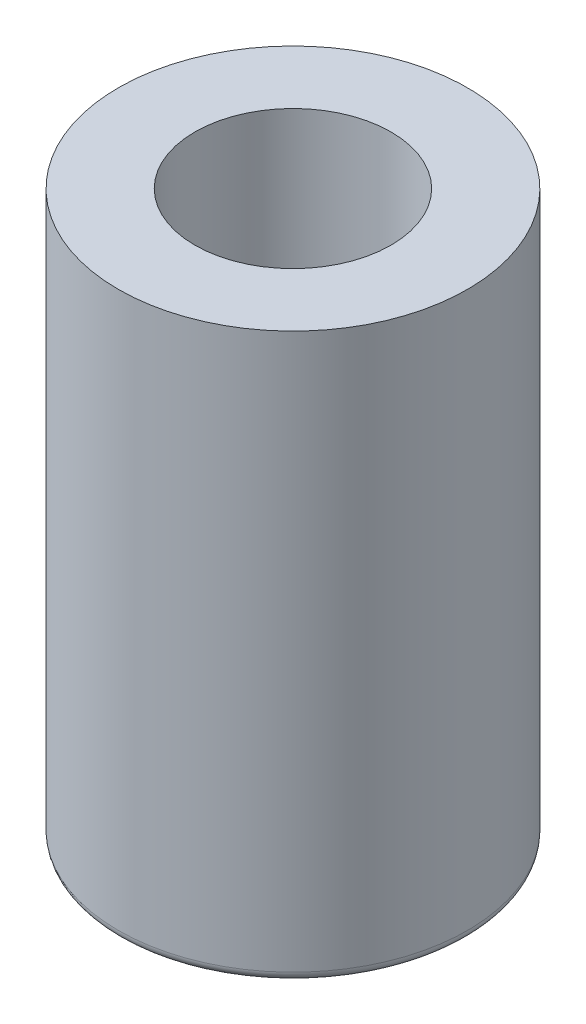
ISO-10303-21;
HEADER;
FILE_DESCRIPTION(('STEP AP214'),'2;1');
FILE_NAME('part.step','',(''),(''),'','','');
FILE_SCHEMA(('AUTOMOTIVE_DESIGN { 1 0 10303 214 1 1 1 1 }'));
ENDSEC;
DATA;
#1=APPLICATION_CONTEXT('core data for automotive mechanical design processes');
#2=APPLICATION_PROTOCOL_DEFINITION('international standard','automotive_design',2000,#1);
#3=PRODUCT_CONTEXT('',#1,'mechanical');
#4=PRODUCT('Part','Part','',(#3));
#5=PRODUCT_RELATED_PRODUCT_CATEGORY('part','',(#4));
#6=PRODUCT_DEFINITION_FORMATION('','',#4);
#7=PRODUCT_DEFINITION_CONTEXT('part definition',#1,'design');
#8=PRODUCT_DEFINITION('design','',#6,#7);
#9=PRODUCT_DEFINITION_SHAPE('','',#8);
#10=(LENGTH_UNIT() NAMED_UNIT(*) SI_UNIT(.MILLI.,.METRE.));
#11=(NAMED_UNIT(*) PLANE_ANGLE_UNIT() SI_UNIT($,.RADIAN.));
#12=(NAMED_UNIT(*) SI_UNIT($,.STERADIAN.) SOLID_ANGLE_UNIT());
#13=UNCERTAINTY_MEASURE_WITH_UNIT(LENGTH_MEASURE(1.E-05),#10,'distance_accuracy_value','');
#14=(GEOMETRIC_REPRESENTATION_CONTEXT(3) GLOBAL_UNCERTAINTY_ASSIGNED_CONTEXT((#13)) GLOBAL_UNIT_ASSIGNED_CONTEXT((#10,
#11,#12)) REPRESENTATION_CONTEXT('',''));
#15=CARTESIAN_POINT('',(0.,0.,0.));
#16=DIRECTION('',(0.,0.,1.));
#17=DIRECTION('',(1.,0.,0.));
#18=AXIS2_PLACEMENT_3D('',#15,#16,#17);
#19=CARTESIAN_POINT('',(0.,144.,0.));
#20=DIRECTION('',(0.,-1.,0.));
#21=DIRECTION('',(0.,0.,-1.));
#22=AXIS2_PLACEMENT_3D('',#19,#20,#21);
#23=CYLINDRICAL_SURFACE('',#22,44.5);
#24=CARTESIAN_POINT('',(0.,2.5,0.));
#25=DIRECTION('',(0.,1.,0.));
#26=DIRECTION('',(0.,0.,1.));
#27=AXIS2_PLACEMENT_3D('',#24,#25,#26);
#28=CIRCLE('',#27,44.5);
#29=CARTESIAN_POINT('',(0.,2.5,44.5));
#30=VERTEX_POINT('',#29);
#31=EDGE_CURVE('E36',#30,#30,#28,.T.);
#32=ORIENTED_EDGE('',*,*,#31,.T.);
#33=EDGE_LOOP('',(#32));
#34=FACE_BOUND('',#33,.T.);
#35=CARTESIAN_POINT('',(0.,144.,0.));
#36=DIRECTION('',(0.,1.,0.));
#37=DIRECTION('',(0.,0.,1.));
#38=AXIS2_PLACEMENT_3D('',#35,#36,#37);
#39=CIRCLE('',#38,44.5);
#40=CARTESIAN_POINT('',(0.,144.,44.5));
#41=VERTEX_POINT('',#40);
#42=EDGE_CURVE('E40',#41,#41,#39,.T.);
#43=ORIENTED_EDGE('',*,*,#42,.F.);
#44=EDGE_LOOP('',(#43));
#45=FACE_BOUND('',#44,.T.);
#46=ADVANCED_FACE('F29',(#34,#45),#23,.T.);
#47=CARTESIAN_POINT('',(0.,144.,0.));
#48=DIRECTION('',(0.,1.,0.));
#49=DIRECTION('',(0.,0.,1.));
#50=AXIS2_PLACEMENT_3D('',#47,#48,#49);
#51=PLANE('',#50);
#52=CARTESIAN_POINT('',(0.,144.,0.));
#53=DIRECTION('',(0.,1.,0.));
#54=DIRECTION('',(0.,0.,1.));
#55=AXIS2_PLACEMENT_3D('',#52,#53,#54);
#56=CIRCLE('',#55,25.);
#57=CARTESIAN_POINT('',(0.,144.,25.));
#58=VERTEX_POINT('',#57);
#59=EDGE_CURVE('E47',#58,#58,#56,.T.);
#60=ORIENTED_EDGE('',*,*,#59,.F.);
#61=EDGE_LOOP('',(#60));
#62=FACE_BOUND('',#61,.T.);
#63=ORIENTED_EDGE('',*,*,#42,.T.);
#64=EDGE_LOOP('',(#63));
#65=FACE_BOUND('',#64,.T.);
#66=ADVANCED_FACE('F61',(#62,#65),#51,.T.);
#67=CARTESIAN_POINT('',(0.,0.,0.));
#68=DIRECTION('',(0.,1.,0.));
#69=DIRECTION('',(0.,0.,1.));
#70=AXIS2_PLACEMENT_3D('',#67,#68,#69);
#71=PLANE('',#70);
#72=CARTESIAN_POINT('',(0.,0.,0.));
#73=DIRECTION('',(0.,1.,0.));
#74=DIRECTION('',(0.,0.,1.));
#75=AXIS2_PLACEMENT_3D('',#72,#73,#74);
#76=CIRCLE('',#75,42.);
#77=CARTESIAN_POINT('',(0.,0.,42.));
#78=VERTEX_POINT('',#77);
#79=EDGE_CURVE('E11',#78,#78,#76,.F.);
#80=ORIENTED_EDGE('',*,*,#79,.T.);
#81=EDGE_LOOP('',(#80));
#82=FACE_BOUND('',#81,.T.);
#83=CARTESIAN_POINT('',(0.,0.,0.));
#84=DIRECTION('',(0.,1.,0.));
#85=DIRECTION('',(0.,0.,1.));
#86=AXIS2_PLACEMENT_3D('',#83,#84,#85);
#87=CIRCLE('',#86,25.);
#88=CARTESIAN_POINT('',(0.,0.,25.));
#89=VERTEX_POINT('',#88);
#90=EDGE_CURVE('E44',#89,#89,#87,.T.);
#91=ORIENTED_EDGE('',*,*,#90,.T.);
#92=EDGE_LOOP('',(#91));
#93=FACE_BOUND('',#92,.T.);
#94=ADVANCED_FACE('F53',(#82,#93),#71,.F.);
#95=CARTESIAN_POINT('',(0.,0.,0.));
#96=DIRECTION('',(0.,1.,0.));
#97=DIRECTION('',(0.,0.,1.));
#98=AXIS2_PLACEMENT_3D('',#95,#96,#97);
#99=CYLINDRICAL_SURFACE('',#98,25.);
#100=ORIENTED_EDGE('',*,*,#90,.F.);
#101=EDGE_LOOP('',(#100));
#102=FACE_BOUND('',#101,.T.);
#103=ORIENTED_EDGE('',*,*,#59,.T.);
#104=EDGE_LOOP('',(#103));
#105=FACE_BOUND('',#104,.T.);
#106=ADVANCED_FACE('F55',(#102,#105),#99,.F.);
#107=CARTESIAN_POINT('',(0.,2.5,0.));
#108=DIRECTION('',(0.,1.,0.));
#109=DIRECTION('',(0.,0.,1.));
#110=AXIS2_PLACEMENT_3D('',#107,#108,#109);
#111=TOROIDAL_SURFACE('',#110,42.,2.5);
#112=ORIENTED_EDGE('',*,*,#79,.F.);
#113=EDGE_LOOP('',(#112));
#114=FACE_BOUND('',#113,.T.);
#115=ORIENTED_EDGE('',*,*,#31,.F.);
#116=EDGE_LOOP('',(#115));
#117=FACE_BOUND('',#116,.T.);
#118=ADVANCED_FACE('F31',(#114,#117),#111,.T.);
#119=CLOSED_SHELL('',(#46,#66,#94,#106,#118));
#120=MANIFOLD_SOLID_BREP('B2',#119);
#121=ADVANCED_BREP_SHAPE_REPRESENTATION('',(#18,#120),#14);
#122=SHAPE_DEFINITION_REPRESENTATION(#9,#121);
ENDSEC;
END-ISO-10303-21;
